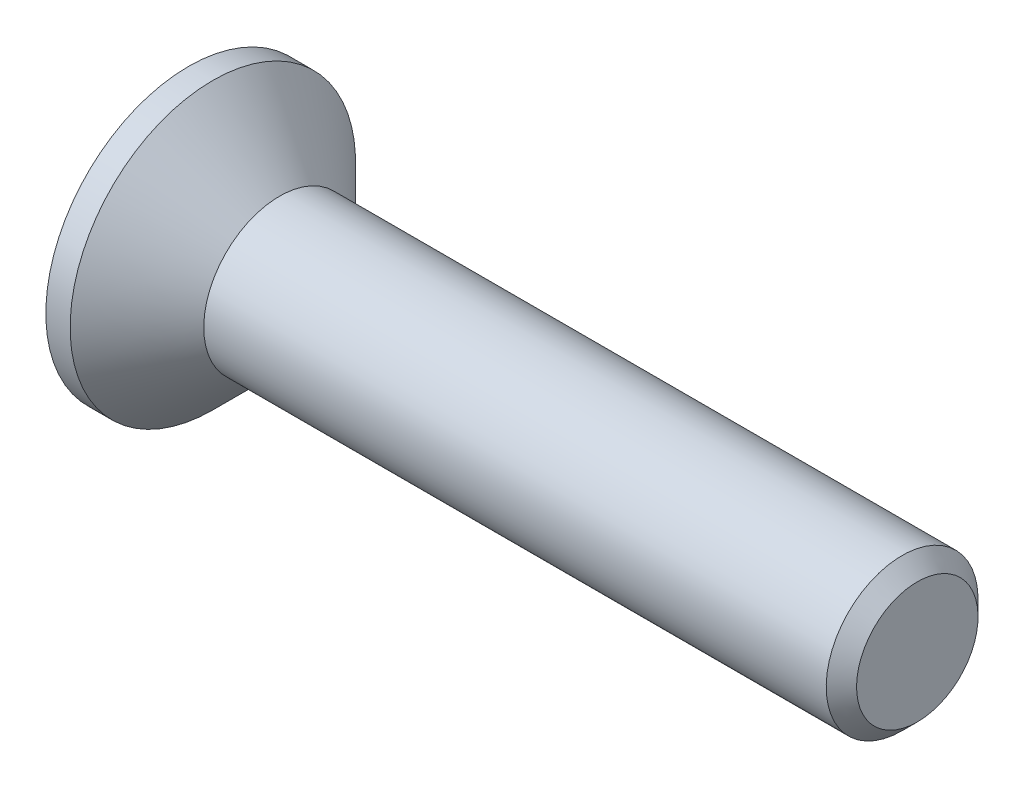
ISO-10303-21;
HEADER;
FILE_DESCRIPTION(('STEP AP214'),'2;1');
FILE_NAME('part.step','',(''),(''),'','','');
FILE_SCHEMA(('AUTOMOTIVE_DESIGN { 1 0 10303 214 1 1 1 1 }'));
ENDSEC;
DATA;
#1=APPLICATION_CONTEXT('core data for automotive mechanical design processes');
#2=APPLICATION_PROTOCOL_DEFINITION('international standard','automotive_design',2000,#1);
#3=PRODUCT_CONTEXT('',#1,'mechanical');
#4=PRODUCT('Part','Part','',(#3));
#5=PRODUCT_RELATED_PRODUCT_CATEGORY('part','',(#4));
#6=PRODUCT_DEFINITION_FORMATION('','',#4);
#7=PRODUCT_DEFINITION_CONTEXT('part definition',#1,'design');
#8=PRODUCT_DEFINITION('design','',#6,#7);
#9=PRODUCT_DEFINITION_SHAPE('','',#8);
#10=(LENGTH_UNIT() NAMED_UNIT(*) SI_UNIT(.MILLI.,.METRE.));
#11=(NAMED_UNIT(*) PLANE_ANGLE_UNIT() SI_UNIT($,.RADIAN.));
#12=(NAMED_UNIT(*) SI_UNIT($,.STERADIAN.) SOLID_ANGLE_UNIT());
#13=UNCERTAINTY_MEASURE_WITH_UNIT(LENGTH_MEASURE(1.E-05),#10,'distance_accuracy_value','');
#14=(GEOMETRIC_REPRESENTATION_CONTEXT(3) GLOBAL_UNCERTAINTY_ASSIGNED_CONTEXT((#13)) GLOBAL_UNIT_ASSIGNED_CONTEXT((#10,
#11,#12)) REPRESENTATION_CONTEXT('',''));
#15=CARTESIAN_POINT('',(0.,0.,0.));
#16=DIRECTION('',(0.,0.,1.));
#17=DIRECTION('',(1.,0.,0.));
#18=AXIS2_PLACEMENT_3D('',#15,#16,#17);
#19=CARTESIAN_POINT('',(0.,0.,0.));
#20=DIRECTION('',(-1.,0.,0.));
#21=DIRECTION('',(0.,-1.,0.));
#22=AXIS2_PLACEMENT_3D('',#19,#20,#21);
#23=CONICAL_SURFACE('',#22,1.25,0.78539816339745);
#24=CARTESIAN_POINT('',(-1.1,0.,0.));
#25=DIRECTION('',(-1.,0.,0.));
#26=DIRECTION('',(0.,-1.,0.));
#27=AXIS2_PLACEMENT_3D('',#24,#25,#26);
#28=CIRCLE('',#27,2.35);
#29=CARTESIAN_POINT('',(-1.1,-2.35,0.));
#30=VERTEX_POINT('',#29);
#31=EDGE_CURVE('E189',#30,#30,#28,.T.);
#32=ORIENTED_EDGE('',*,*,#31,.F.);
#33=EDGE_LOOP('',(#32));
#34=FACE_BOUND('',#33,.T.);
#35=CARTESIAN_POINT('',(0.,0.,0.));
#36=DIRECTION('',(-1.,0.,0.));
#37=DIRECTION('',(0.,-1.,0.));
#38=AXIS2_PLACEMENT_3D('',#35,#36,#37);
#39=CIRCLE('',#38,1.25);
#40=CARTESIAN_POINT('',(0.,-1.25,0.));
#41=VERTEX_POINT('',#40);
#42=EDGE_CURVE('E212',#41,#41,#39,.T.);
#43=ORIENTED_EDGE('',*,*,#42,.T.);
#44=EDGE_LOOP('',(#43));
#45=FACE_BOUND('',#44,.T.);
#46=ADVANCED_FACE('F33',(#34,#45),#23,.T.);
#47=CARTESIAN_POINT('',(-1.5,0.,0.));
#48=DIRECTION('',(-1.,0.,0.));
#49=DIRECTION('',(0.,-1.,0.));
#50=AXIS2_PLACEMENT_3D('',#47,#48,#49);
#51=CYLINDRICAL_SURFACE('',#50,1.25);
#52=CARTESIAN_POINT('',(10.25,0.,0.));
#53=DIRECTION('',(-1.,0.,0.));
#54=DIRECTION('',(0.,-1.,0.));
#55=AXIS2_PLACEMENT_3D('',#52,#53,#54);
#56=CIRCLE('',#55,1.25);
#57=CARTESIAN_POINT('',(10.25,-1.25,0.));
#58=VERTEX_POINT('',#57);
#59=EDGE_CURVE('E41',#58,#58,#56,.T.);
#60=ORIENTED_EDGE('',*,*,#59,.T.);
#61=EDGE_LOOP('',(#60));
#62=FACE_BOUND('',#61,.T.);
#63=ORIENTED_EDGE('',*,*,#42,.F.);
#64=EDGE_LOOP('',(#63));
#65=FACE_BOUND('',#64,.T.);
#66=ADVANCED_FACE('F217',(#62,#65),#51,.T.);
#67=CARTESIAN_POINT('',(10.5,0.,0.));
#68=DIRECTION('',(-1.,0.,0.));
#69=DIRECTION('',(0.,-1.,0.));
#70=AXIS2_PLACEMENT_3D('',#67,#68,#69);
#71=PLANE('',#70);
#72=CARTESIAN_POINT('',(10.5,0.,0.));
#73=DIRECTION('',(-1.,0.,0.));
#74=DIRECTION('',(0.,-1.,0.));
#75=AXIS2_PLACEMENT_3D('',#72,#73,#74);
#76=CIRCLE('',#75,0.999999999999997);
#77=CARTESIAN_POINT('',(10.5,-0.999999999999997,0.));
#78=VERTEX_POINT('',#77);
#79=EDGE_CURVE('E11',#78,#78,#76,.F.);
#80=ORIENTED_EDGE('',*,*,#79,.T.);
#81=EDGE_LOOP('',(#80));
#82=FACE_BOUND('',#81,.T.);
#83=ADVANCED_FACE('F239',(#82),#71,.F.);
#84=CARTESIAN_POINT('',(-1.5,2.35,0.));
#85=DIRECTION('',(1.,0.,0.));
#86=DIRECTION('',(0.,1.,0.));
#87=AXIS2_PLACEMENT_3D('',#84,#85,#86);
#88=PLANE('',#87);
#89=DIRECTION('',(0.,0.,-1.));
#90=VECTOR('',#89,1.);
#91=CARTESIAN_POINT('',(-1.5,0.34,-1.35));
#92=LINE('',#91,#90);
#93=CARTESIAN_POINT('',(-1.5,0.34,-0.34));
#94=VERTEX_POINT('',#93);
#95=CARTESIAN_POINT('',(-1.5,0.34,-1.35));
#96=VERTEX_POINT('',#95);
#97=EDGE_CURVE('E158',#94,#96,#92,.T.);
#98=ORIENTED_EDGE('',*,*,#97,.F.);
#99=DIRECTION('',(0.,-1.,0.));
#100=VECTOR('',#99,1.);
#101=CARTESIAN_POINT('',(-1.5,0.34,-0.34));
#102=LINE('',#101,#100);
#103=CARTESIAN_POINT('',(-1.5,1.35,-0.34));
#104=VERTEX_POINT('',#103);
#105=EDGE_CURVE('E48',#104,#94,#102,.T.);
#106=ORIENTED_EDGE('',*,*,#105,.F.);
#107=DIRECTION('',(0.,0.,-1.));
#108=VECTOR('',#107,1.);
#109=CARTESIAN_POINT('',(-1.5,1.35,-0.34));
#110=LINE('',#109,#108);
#111=CARTESIAN_POINT('',(-1.5,1.35,0.34));
#112=VERTEX_POINT('',#111);
#113=EDGE_CURVE('E185',#112,#104,#110,.T.);
#114=ORIENTED_EDGE('',*,*,#113,.F.);
#115=DIRECTION('',(0.,1.,0.));
#116=VECTOR('',#115,1.);
#117=CARTESIAN_POINT('',(-1.5,1.35,0.34));
#118=LINE('',#117,#116);
#119=CARTESIAN_POINT('',(-1.5,0.34,0.34));
#120=VERTEX_POINT('',#119);
#121=EDGE_CURVE('E183',#120,#112,#118,.T.);
#122=ORIENTED_EDGE('',*,*,#121,.F.);
#123=DIRECTION('',(0.,0.,-1.));
#124=VECTOR('',#123,1.);
#125=CARTESIAN_POINT('',(-1.5,0.34,0.34));
#126=LINE('',#125,#124);
#127=CARTESIAN_POINT('',(-1.5,0.34,1.35));
#128=VERTEX_POINT('',#127);
#129=EDGE_CURVE('E132',#128,#120,#126,.T.);
#130=ORIENTED_EDGE('',*,*,#129,.F.);
#131=DIRECTION('',(0.,1.,0.));
#132=VECTOR('',#131,1.);
#133=CARTESIAN_POINT('',(-1.5,0.34,1.35));
#134=LINE('',#133,#132);
#135=CARTESIAN_POINT('',(-1.5,-0.34,1.35));
#136=VERTEX_POINT('',#135);
#137=EDGE_CURVE('E179',#136,#128,#134,.T.);
#138=ORIENTED_EDGE('',*,*,#137,.F.);
#139=DIRECTION('',(0.,0.,1.));
#140=VECTOR('',#139,1.);
#141=CARTESIAN_POINT('',(-1.5,-0.34,1.35));
#142=LINE('',#141,#140);
#143=CARTESIAN_POINT('',(-1.5,-0.34,0.34));
#144=VERTEX_POINT('',#143);
#145=EDGE_CURVE('E176',#144,#136,#142,.T.);
#146=ORIENTED_EDGE('',*,*,#145,.F.);
#147=DIRECTION('',(0.,1.,0.));
#148=VECTOR('',#147,1.);
#149=CARTESIAN_POINT('',(-1.5,-0.34,0.34));
#150=LINE('',#149,#148);
#151=CARTESIAN_POINT('',(-1.5,-1.35,0.34));
#152=VERTEX_POINT('',#151);
#153=EDGE_CURVE('E173',#152,#144,#150,.T.);
#154=ORIENTED_EDGE('',*,*,#153,.F.);
#155=DIRECTION('',(0.,0.,1.));
#156=VECTOR('',#155,1.);
#157=CARTESIAN_POINT('',(-1.5,-1.35,0.34));
#158=LINE('',#157,#156);
#159=CARTESIAN_POINT('',(-1.5,-1.35,-0.34));
#160=VERTEX_POINT('',#159);
#161=EDGE_CURVE('E170',#160,#152,#158,.T.);
#162=ORIENTED_EDGE('',*,*,#161,.F.);
#163=DIRECTION('',(0.,-1.,0.));
#164=VECTOR('',#163,1.);
#165=CARTESIAN_POINT('',(-1.5,-1.35,-0.34));
#166=LINE('',#165,#164);
#167=CARTESIAN_POINT('',(-1.5,-0.34,-0.34));
#168=VERTEX_POINT('',#167);
#169=EDGE_CURVE('E167',#168,#160,#166,.T.);
#170=ORIENTED_EDGE('',*,*,#169,.F.);
#171=DIRECTION('',(0.,0.,1.));
#172=VECTOR('',#171,1.);
#173=CARTESIAN_POINT('',(-1.5,-0.34,-0.34));
#174=LINE('',#173,#172);
#175=CARTESIAN_POINT('',(-1.5,-0.34,-1.35));
#176=VERTEX_POINT('',#175);
#177=EDGE_CURVE('E164',#176,#168,#174,.T.);
#178=ORIENTED_EDGE('',*,*,#177,.F.);
#179=DIRECTION('',(0.,-1.,0.));
#180=VECTOR('',#179,1.);
#181=CARTESIAN_POINT('',(-1.5,-0.34,-1.35));
#182=LINE('',#181,#180);
#183=EDGE_CURVE('E161',#96,#176,#182,.T.);
#184=ORIENTED_EDGE('',*,*,#183,.F.);
#185=EDGE_LOOP('',(#98,#106,#114,#122,#130,#138,#146,#154,#162,#170,#178,#184));
#186=FACE_BOUND('',#185,.T.);
#187=CARTESIAN_POINT('',(-1.5,0.,0.));
#188=DIRECTION('',(-1.,0.,0.));
#189=DIRECTION('',(0.,-1.,0.));
#190=AXIS2_PLACEMENT_3D('',#187,#188,#189);
#191=CIRCLE('',#190,2.35);
#192=CARTESIAN_POINT('',(-1.5,-2.35,0.));
#193=VERTEX_POINT('',#192);
#194=EDGE_CURVE('E209',#193,#193,#191,.T.);
#195=ORIENTED_EDGE('',*,*,#194,.T.);
#196=EDGE_LOOP('',(#195));
#197=FACE_BOUND('',#196,.T.);
#198=ADVANCED_FACE('F230',(#186,#197),#88,.F.);
#199=CARTESIAN_POINT('',(-1.5,0.,0.));
#200=DIRECTION('',(-1.,0.,0.));
#201=DIRECTION('',(0.,-1.,0.));
#202=AXIS2_PLACEMENT_3D('',#199,#200,#201);
#203=CYLINDRICAL_SURFACE('',#202,2.35);
#204=ORIENTED_EDGE('',*,*,#194,.F.);
#205=EDGE_LOOP('',(#204));
#206=FACE_BOUND('',#205,.T.);
#207=ORIENTED_EDGE('',*,*,#31,.T.);
#208=EDGE_LOOP('',(#207));
#209=FACE_BOUND('',#208,.T.);
#210=ADVANCED_FACE('F222',(#206,#209),#203,.T.);
#211=CARTESIAN_POINT('',(10.25,0.,0.));
#212=DIRECTION('',(-1.,0.,0.));
#213=DIRECTION('',(0.,-1.,0.));
#214=AXIS2_PLACEMENT_3D('',#211,#212,#213);
#215=CONICAL_SURFACE('',#214,1.25,0.785398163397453);
#216=ORIENTED_EDGE('',*,*,#79,.F.);
#217=EDGE_LOOP('',(#216));
#218=FACE_BOUND('',#217,.T.);
#219=ORIENTED_EDGE('',*,*,#59,.F.);
#220=EDGE_LOOP('',(#219));
#221=FACE_BOUND('',#220,.T.);
#222=ADVANCED_FACE('F35',(#218,#221),#215,.T.);
#223=CARTESIAN_POINT('',(-0.25,0.34,-0.34));
#224=DIRECTION('',(0.,0.,-1.));
#225=DIRECTION('',(-1.,0.,0.));
#226=AXIS2_PLACEMENT_3D('',#223,#224,#225);
#227=PLANE('',#226);
#228=ORIENTED_EDGE('',*,*,#105,.T.);
#229=DIRECTION('',(-1.,0.,0.));
#230=VECTOR('',#229,1.);
#231=CARTESIAN_POINT('',(-0.25,0.34,-0.34));
#232=LINE('',#231,#230);
#233=CARTESIAN_POINT('',(-0.25,0.34,-0.34));
#234=VERTEX_POINT('',#233);
#235=EDGE_CURVE('E96',#234,#94,#232,.T.);
#236=ORIENTED_EDGE('',*,*,#235,.F.);
#237=DIRECTION('',(0.,-1.,0.));
#238=VECTOR('',#237,1.);
#239=CARTESIAN_POINT('',(-0.25,0.34,-0.34));
#240=LINE('',#239,#238);
#241=CARTESIAN_POINT('',(-0.25,1.35,-0.34));
#242=VERTEX_POINT('',#241);
#243=EDGE_CURVE('E187',#242,#234,#240,.T.);
#244=ORIENTED_EDGE('',*,*,#243,.F.);
#245=DIRECTION('',(-1.,0.,0.));
#246=VECTOR('',#245,1.);
#247=CARTESIAN_POINT('',(-0.25,1.35,-0.34));
#248=LINE('',#247,#246);
#249=EDGE_CURVE('E56',#242,#104,#248,.T.);
#250=ORIENTED_EDGE('',*,*,#249,.T.);
#251=EDGE_LOOP('',(#228,#236,#244,#250));
#252=FACE_BOUND('',#251,.T.);
#253=ADVANCED_FACE('F221',(#252),#227,.F.);
#254=CARTESIAN_POINT('',(-0.25,1.35,-0.34));
#255=DIRECTION('',(0.,1.,0.));
#256=DIRECTION('',(-1.,0.,0.));
#257=AXIS2_PLACEMENT_3D('',#254,#255,#256);
#258=PLANE('',#257);
#259=ORIENTED_EDGE('',*,*,#113,.T.);
#260=ORIENTED_EDGE('',*,*,#249,.F.);
#261=DIRECTION('',(0.,0.,-1.));
#262=VECTOR('',#261,1.);
#263=CARTESIAN_POINT('',(-0.25,1.35,-0.34));
#264=LINE('',#263,#262);
#265=CARTESIAN_POINT('',(-0.25,1.35,0.34));
#266=VERTEX_POINT('',#265);
#267=EDGE_CURVE('E144',#266,#242,#264,.T.);
#268=ORIENTED_EDGE('',*,*,#267,.F.);
#269=DIRECTION('',(-1.,0.,0.));
#270=VECTOR('',#269,1.);
#271=CARTESIAN_POINT('',(-0.25,1.35,0.34));
#272=LINE('',#271,#270);
#273=EDGE_CURVE('E136',#266,#112,#272,.T.);
#274=ORIENTED_EDGE('',*,*,#273,.T.);
#275=EDGE_LOOP('',(#259,#260,#268,#274));
#276=FACE_BOUND('',#275,.T.);
#277=ADVANCED_FACE('F228',(#276),#258,.F.);
#278=CARTESIAN_POINT('',(-0.25,1.35,0.34));
#279=DIRECTION('',(0.,0.,1.));
#280=DIRECTION('',(1.,0.,0.));
#281=AXIS2_PLACEMENT_3D('',#278,#279,#280);
#282=PLANE('',#281);
#283=ORIENTED_EDGE('',*,*,#121,.T.);
#284=ORIENTED_EDGE('',*,*,#273,.F.);
#285=DIRECTION('',(0.,1.,0.));
#286=VECTOR('',#285,1.);
#287=CARTESIAN_POINT('',(-0.25,1.35,0.34));
#288=LINE('',#287,#286);
#289=CARTESIAN_POINT('',(-0.25,0.34,0.34));
#290=VERTEX_POINT('',#289);
#291=EDGE_CURVE('E140',#290,#266,#288,.T.);
#292=ORIENTED_EDGE('',*,*,#291,.F.);
#293=DIRECTION('',(-1.,0.,0.));
#294=VECTOR('',#293,1.);
#295=CARTESIAN_POINT('',(-0.25,0.34,0.34));
#296=LINE('',#295,#294);
#297=EDGE_CURVE('E125',#290,#120,#296,.T.);
#298=ORIENTED_EDGE('',*,*,#297,.T.);
#299=EDGE_LOOP('',(#283,#284,#292,#298));
#300=FACE_BOUND('',#299,.T.);
#301=ADVANCED_FACE('F141',(#300),#282,.F.);
#302=CARTESIAN_POINT('',(-0.25,0.34,0.34));
#303=DIRECTION('',(0.,1.,0.));
#304=DIRECTION('',(-1.,0.,0.));
#305=AXIS2_PLACEMENT_3D('',#302,#303,#304);
#306=PLANE('',#305);
#307=ORIENTED_EDGE('',*,*,#129,.T.);
#308=ORIENTED_EDGE('',*,*,#297,.F.);
#309=DIRECTION('',(0.,0.,-1.));
#310=VECTOR('',#309,1.);
#311=CARTESIAN_POINT('',(-0.25,0.34,0.34));
#312=LINE('',#311,#310);
#313=CARTESIAN_POINT('',(-0.25,0.34,1.35));
#314=VERTEX_POINT('',#313);
#315=EDGE_CURVE('E129',#314,#290,#312,.T.);
#316=ORIENTED_EDGE('',*,*,#315,.F.);
#317=DIRECTION('',(-1.,0.,0.));
#318=VECTOR('',#317,1.);
#319=CARTESIAN_POINT('',(-0.25,0.34,1.35));
#320=LINE('',#319,#318);
#321=EDGE_CURVE('E137',#314,#128,#320,.T.);
#322=ORIENTED_EDGE('',*,*,#321,.T.);
#323=EDGE_LOOP('',(#307,#308,#316,#322));
#324=FACE_BOUND('',#323,.T.);
#325=ADVANCED_FACE('F127',(#324),#306,.F.);
#326=CARTESIAN_POINT('',(-0.25,0.34,1.35));
#327=DIRECTION('',(0.,0.,1.));
#328=DIRECTION('',(1.,0.,0.));
#329=AXIS2_PLACEMENT_3D('',#326,#327,#328);
#330=PLANE('',#329);
#331=ORIENTED_EDGE('',*,*,#137,.T.);
#332=ORIENTED_EDGE('',*,*,#321,.F.);
#333=DIRECTION('',(0.,1.,0.));
#334=VECTOR('',#333,1.);
#335=CARTESIAN_POINT('',(-0.25,0.34,1.35));
#336=LINE('',#335,#334);
#337=CARTESIAN_POINT('',(-0.25,-0.34,1.35));
#338=VERTEX_POINT('',#337);
#339=EDGE_CURVE('E150',#338,#314,#336,.T.);
#340=ORIENTED_EDGE('',*,*,#339,.F.);
#341=DIRECTION('',(-1.,0.,0.));
#342=VECTOR('',#341,1.);
#343=CARTESIAN_POINT('',(-0.25,-0.34,1.35));
#344=LINE('',#343,#342);
#345=EDGE_CURVE('E192',#338,#136,#344,.T.);
#346=ORIENTED_EDGE('',*,*,#345,.T.);
#347=EDGE_LOOP('',(#331,#332,#340,#346));
#348=FACE_BOUND('',#347,.T.);
#349=ADVANCED_FACE('F277',(#348),#330,.F.);
#350=CARTESIAN_POINT('',(-0.25,-0.34,1.35));
#351=DIRECTION('',(0.,-1.,0.));
#352=DIRECTION('',(1.,0.,0.));
#353=AXIS2_PLACEMENT_3D('',#350,#351,#352);
#354=PLANE('',#353);
#355=ORIENTED_EDGE('',*,*,#145,.T.);
#356=ORIENTED_EDGE('',*,*,#345,.F.);
#357=DIRECTION('',(0.,0.,1.));
#358=VECTOR('',#357,1.);
#359=CARTESIAN_POINT('',(-0.25,-0.34,1.35));
#360=LINE('',#359,#358);
#361=CARTESIAN_POINT('',(-0.25,-0.34,0.34));
#362=VERTEX_POINT('',#361);
#363=EDGE_CURVE('E152',#362,#338,#360,.T.);
#364=ORIENTED_EDGE('',*,*,#363,.F.);
#365=DIRECTION('',(-1.,0.,0.));
#366=VECTOR('',#365,1.);
#367=CARTESIAN_POINT('',(-0.25,-0.34,0.34));
#368=LINE('',#367,#366);
#369=EDGE_CURVE('E194',#362,#144,#368,.T.);
#370=ORIENTED_EDGE('',*,*,#369,.T.);
#371=EDGE_LOOP('',(#355,#356,#364,#370));
#372=FACE_BOUND('',#371,.T.);
#373=ADVANCED_FACE('F273',(#372),#354,.F.);
#374=CARTESIAN_POINT('',(-0.25,-0.34,0.34));
#375=DIRECTION('',(0.,0.,1.));
#376=DIRECTION('',(1.,0.,0.));
#377=AXIS2_PLACEMENT_3D('',#374,#375,#376);
#378=PLANE('',#377);
#379=ORIENTED_EDGE('',*,*,#153,.T.);
#380=ORIENTED_EDGE('',*,*,#369,.F.);
#381=DIRECTION('',(0.,1.,0.));
#382=VECTOR('',#381,1.);
#383=CARTESIAN_POINT('',(-0.25,-0.34,0.34));
#384=LINE('',#383,#382);
#385=CARTESIAN_POINT('',(-0.25,-1.35,0.34));
#386=VERTEX_POINT('',#385);
#387=EDGE_CURVE('E422',#386,#362,#384,.T.);
#388=ORIENTED_EDGE('',*,*,#387,.F.);
#389=DIRECTION('',(-1.,0.,0.));
#390=VECTOR('',#389,1.);
#391=CARTESIAN_POINT('',(-0.25,-1.35,0.34));
#392=LINE('',#391,#390);
#393=EDGE_CURVE('E196',#386,#152,#392,.T.);
#394=ORIENTED_EDGE('',*,*,#393,.T.);
#395=EDGE_LOOP('',(#379,#380,#388,#394));
#396=FACE_BOUND('',#395,.T.);
#397=ADVANCED_FACE('F269',(#396),#378,.F.);
#398=CARTESIAN_POINT('',(-0.25,-1.35,0.34));
#399=DIRECTION('',(0.,-1.,0.));
#400=DIRECTION('',(1.,0.,0.));
#401=AXIS2_PLACEMENT_3D('',#398,#399,#400);
#402=PLANE('',#401);
#403=ORIENTED_EDGE('',*,*,#161,.T.);
#404=ORIENTED_EDGE('',*,*,#393,.F.);
#405=DIRECTION('',(0.,0.,1.));
#406=VECTOR('',#405,1.);
#407=CARTESIAN_POINT('',(-0.25,-1.35,0.34));
#408=LINE('',#407,#406);
#409=CARTESIAN_POINT('',(-0.25,-1.35,-0.34));
#410=VERTEX_POINT('',#409);
#411=EDGE_CURVE('E419',#410,#386,#408,.T.);
#412=ORIENTED_EDGE('',*,*,#411,.F.);
#413=DIRECTION('',(-1.,0.,0.));
#414=VECTOR('',#413,1.);
#415=CARTESIAN_POINT('',(-0.25,-1.35,-0.34));
#416=LINE('',#415,#414);
#417=EDGE_CURVE('E198',#410,#160,#416,.T.);
#418=ORIENTED_EDGE('',*,*,#417,.T.);
#419=EDGE_LOOP('',(#403,#404,#412,#418));
#420=FACE_BOUND('',#419,.T.);
#421=ADVANCED_FACE('F265',(#420),#402,.F.);
#422=CARTESIAN_POINT('',(-0.25,-1.35,-0.34));
#423=DIRECTION('',(0.,0.,-1.));
#424=DIRECTION('',(-1.,0.,0.));
#425=AXIS2_PLACEMENT_3D('',#422,#423,#424);
#426=PLANE('',#425);
#427=ORIENTED_EDGE('',*,*,#169,.T.);
#428=ORIENTED_EDGE('',*,*,#417,.F.);
#429=DIRECTION('',(0.,-1.,0.));
#430=VECTOR('',#429,1.);
#431=CARTESIAN_POINT('',(-0.25,-1.35,-0.34));
#432=LINE('',#431,#430);
#433=CARTESIAN_POINT('',(-0.25,-0.34,-0.34));
#434=VERTEX_POINT('',#433);
#435=EDGE_CURVE('E416',#434,#410,#432,.T.);
#436=ORIENTED_EDGE('',*,*,#435,.F.);
#437=DIRECTION('',(-1.,0.,0.));
#438=VECTOR('',#437,1.);
#439=CARTESIAN_POINT('',(-0.25,-0.34,-0.34));
#440=LINE('',#439,#438);
#441=EDGE_CURVE('E200',#434,#168,#440,.T.);
#442=ORIENTED_EDGE('',*,*,#441,.T.);
#443=EDGE_LOOP('',(#427,#428,#436,#442));
#444=FACE_BOUND('',#443,.T.);
#445=ADVANCED_FACE('F261',(#444),#426,.F.);
#446=CARTESIAN_POINT('',(-0.25,-0.34,-0.34));
#447=DIRECTION('',(0.,-1.,0.));
#448=DIRECTION('',(1.,0.,0.));
#449=AXIS2_PLACEMENT_3D('',#446,#447,#448);
#450=PLANE('',#449);
#451=ORIENTED_EDGE('',*,*,#177,.T.);
#452=ORIENTED_EDGE('',*,*,#441,.F.);
#453=DIRECTION('',(0.,0.,1.));
#454=VECTOR('',#453,1.);
#455=CARTESIAN_POINT('',(-0.25,-0.34,-0.34));
#456=LINE('',#455,#454);
#457=CARTESIAN_POINT('',(-0.25,-0.34,-1.35));
#458=VERTEX_POINT('',#457);
#459=EDGE_CURVE('E413',#458,#434,#456,.T.);
#460=ORIENTED_EDGE('',*,*,#459,.F.);
#461=DIRECTION('',(-1.,0.,0.));
#462=VECTOR('',#461,1.);
#463=CARTESIAN_POINT('',(-0.25,-0.34,-1.35));
#464=LINE('',#463,#462);
#465=EDGE_CURVE('E202',#458,#176,#464,.T.);
#466=ORIENTED_EDGE('',*,*,#465,.T.);
#467=EDGE_LOOP('',(#451,#452,#460,#466));
#468=FACE_BOUND('',#467,.T.);
#469=ADVANCED_FACE('F257',(#468),#450,.F.);
#470=CARTESIAN_POINT('',(-0.25,-0.34,-1.35));
#471=DIRECTION('',(0.,0.,-1.));
#472=DIRECTION('',(-1.,0.,0.));
#473=AXIS2_PLACEMENT_3D('',#470,#471,#472);
#474=PLANE('',#473);
#475=ORIENTED_EDGE('',*,*,#183,.T.);
#476=ORIENTED_EDGE('',*,*,#465,.F.);
#477=DIRECTION('',(0.,-1.,0.));
#478=VECTOR('',#477,1.);
#479=CARTESIAN_POINT('',(-0.25,-0.34,-1.35));
#480=LINE('',#479,#478);
#481=CARTESIAN_POINT('',(-0.25,0.34,-1.35));
#482=VERTEX_POINT('',#481);
#483=EDGE_CURVE('E408',#482,#458,#480,.T.);
#484=ORIENTED_EDGE('',*,*,#483,.F.);
#485=DIRECTION('',(-1.,0.,0.));
#486=VECTOR('',#485,1.);
#487=CARTESIAN_POINT('',(-0.25,0.34,-1.35));
#488=LINE('',#487,#486);
#489=EDGE_CURVE('E204',#482,#96,#488,.T.);
#490=ORIENTED_EDGE('',*,*,#489,.T.);
#491=EDGE_LOOP('',(#475,#476,#484,#490));
#492=FACE_BOUND('',#491,.T.);
#493=ADVANCED_FACE('F253',(#492),#474,.F.);
#494=CARTESIAN_POINT('',(-0.25,0.34,-1.35));
#495=DIRECTION('',(0.,1.,0.));
#496=DIRECTION('',(-1.,0.,0.));
#497=AXIS2_PLACEMENT_3D('',#494,#495,#496);
#498=PLANE('',#497);
#499=ORIENTED_EDGE('',*,*,#97,.T.);
#500=ORIENTED_EDGE('',*,*,#489,.F.);
#501=DIRECTION('',(0.,0.,-1.));
#502=VECTOR('',#501,1.);
#503=CARTESIAN_POINT('',(-0.25,0.34,-1.35));
#504=LINE('',#503,#502);
#505=EDGE_CURVE('E406',#234,#482,#504,.T.);
#506=ORIENTED_EDGE('',*,*,#505,.F.);
#507=ORIENTED_EDGE('',*,*,#235,.T.);
#508=EDGE_LOOP('',(#499,#500,#506,#507));
#509=FACE_BOUND('',#508,.T.);
#510=ADVANCED_FACE('F250',(#509),#498,.F.);
#511=CARTESIAN_POINT('',(-0.25,0.,0.));
#512=DIRECTION('',(1.,0.,0.));
#513=DIRECTION('',(0.,0.,-1.));
#514=AXIS2_PLACEMENT_3D('',#511,#512,#513);
#515=PLANE('',#514);
#516=ORIENTED_EDGE('',*,*,#243,.T.);
#517=ORIENTED_EDGE('',*,*,#505,.T.);
#518=ORIENTED_EDGE('',*,*,#483,.T.);
#519=ORIENTED_EDGE('',*,*,#459,.T.);
#520=ORIENTED_EDGE('',*,*,#435,.T.);
#521=ORIENTED_EDGE('',*,*,#411,.T.);
#522=ORIENTED_EDGE('',*,*,#387,.T.);
#523=ORIENTED_EDGE('',*,*,#363,.T.);
#524=ORIENTED_EDGE('',*,*,#339,.T.);
#525=ORIENTED_EDGE('',*,*,#315,.T.);
#526=ORIENTED_EDGE('',*,*,#291,.T.);
#527=ORIENTED_EDGE('',*,*,#267,.T.);
#528=EDGE_LOOP('',(#516,#517,#518,#519,#520,#521,#522,#523,#524,#525,#526,#527));
#529=FACE_BOUND('',#528,.T.);
#530=ADVANCED_FACE('F147',(#529),#515,.F.);
#531=CLOSED_SHELL('',(#46,#66,#83,#198,#210,#222,#253,#277,#301,#325,#349,#373,#397,#421,#445,
#469,#493,#510,#530));
#532=MANIFOLD_SOLID_BREP('B2',#531);
#533=ADVANCED_BREP_SHAPE_REPRESENTATION('',(#18,#532),#14);
#534=SHAPE_DEFINITION_REPRESENTATION(#9,#533);
ENDSEC;
END-ISO-10303-21;
